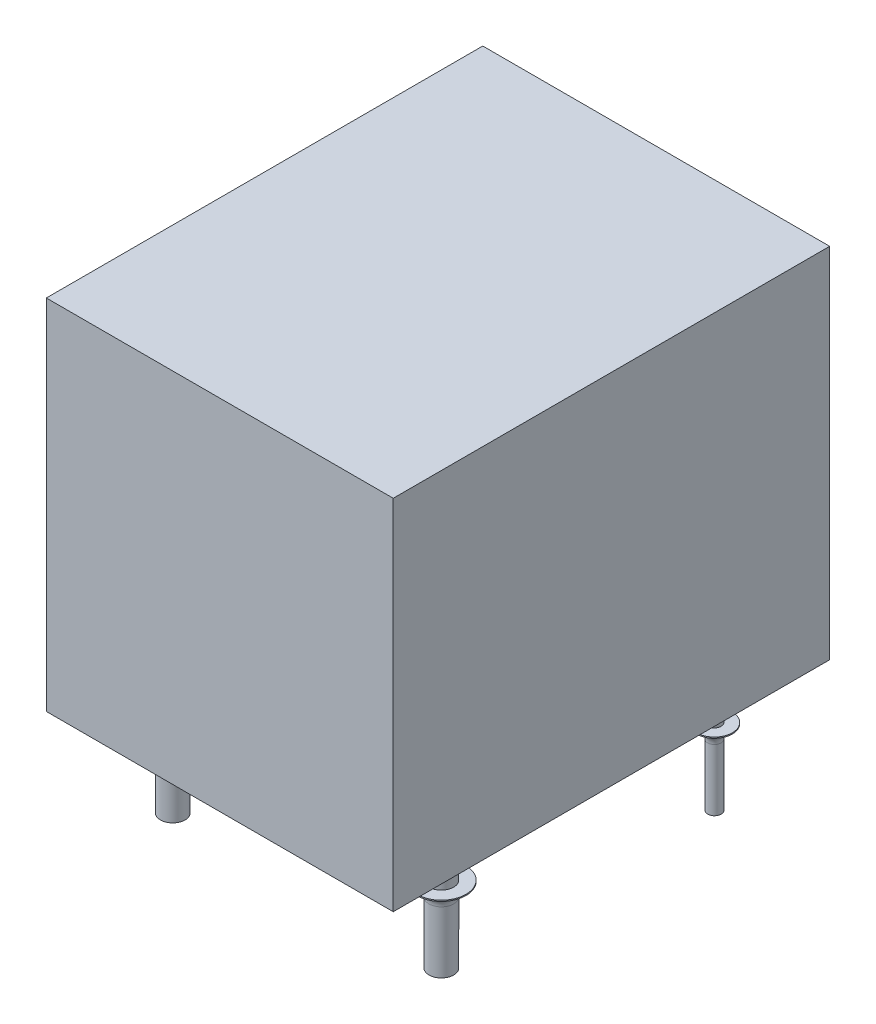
ISO-10303-21;
HEADER;
FILE_DESCRIPTION(('STEP AP214'),'2;1');
FILE_NAME('part.step','',(''),(''),'','','');
FILE_SCHEMA(('AUTOMOTIVE_DESIGN { 1 0 10303 214 1 1 1 1 }'));
ENDSEC;
DATA;
#1=APPLICATION_CONTEXT('core data for automotive mechanical design processes');
#2=APPLICATION_PROTOCOL_DEFINITION('international standard','automotive_design',2000,#1);
#3=PRODUCT_CONTEXT('',#1,'mechanical');
#4=PRODUCT('Part','Part','',(#3));
#5=PRODUCT_RELATED_PRODUCT_CATEGORY('part','',(#4));
#6=PRODUCT_DEFINITION_FORMATION('','',#4);
#7=PRODUCT_DEFINITION_CONTEXT('part definition',#1,'design');
#8=PRODUCT_DEFINITION('design','',#6,#7);
#9=PRODUCT_DEFINITION_SHAPE('','',#8);
#10=(LENGTH_UNIT() NAMED_UNIT(*) SI_UNIT(.MILLI.,.METRE.));
#11=(NAMED_UNIT(*) PLANE_ANGLE_UNIT() SI_UNIT($,.RADIAN.));
#12=(NAMED_UNIT(*) SI_UNIT($,.STERADIAN.) SOLID_ANGLE_UNIT());
#13=UNCERTAINTY_MEASURE_WITH_UNIT(LENGTH_MEASURE(1.E-05),#10,'distance_accuracy_value','');
#14=(GEOMETRIC_REPRESENTATION_CONTEXT(3) GLOBAL_UNCERTAINTY_ASSIGNED_CONTEXT((#13)) GLOBAL_UNIT_ASSIGNED_CONTEXT((#10,
#11,#12)) REPRESENTATION_CONTEXT('',''));
#15=CARTESIAN_POINT('',(0.,0.,0.));
#16=DIRECTION('',(0.,0.,1.));
#17=DIRECTION('',(1.,0.,0.));
#18=AXIS2_PLACEMENT_3D('',#15,#16,#17);
#19=CARTESIAN_POINT('',(13.75,-5.,-16.1));
#20=DIRECTION('',(0.,1.,0.));
#21=DIRECTION('',(0.,0.,1.));
#22=AXIS2_PLACEMENT_3D('',#19,#20,#21);
#23=CYLINDRICAL_SURFACE('',#22,0.300000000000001);
#24=CARTESIAN_POINT('',(13.75,0.,-16.1));
#25=DIRECTION('',(0.,-1.,0.));
#26=DIRECTION('',(0.,0.,-1.));
#27=AXIS2_PLACEMENT_3D('',#24,#25,#26);
#28=CIRCLE('',#27,0.300000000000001);
#29=CARTESIAN_POINT('',(13.75,0.,-16.4));
#30=VERTEX_POINT('',#29);
#31=EDGE_CURVE('E188',#30,#30,#28,.T.);
#32=ORIENTED_EDGE('',*,*,#31,.T.);
#33=EDGE_LOOP('',(#32));
#34=FACE_BOUND('',#33,.T.);
#35=CARTESIAN_POINT('',(13.75,-1.6,-16.1));
#36=DIRECTION('',(0.,-1.,0.));
#37=DIRECTION('',(0.,0.,-1.));
#38=AXIS2_PLACEMENT_3D('',#35,#36,#37);
#39=CIRCLE('',#38,0.300000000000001);
#40=CARTESIAN_POINT('',(13.75,-1.6,-16.4));
#41=VERTEX_POINT('',#40);
#42=EDGE_CURVE('E124',#41,#41,#39,.T.);
#43=ORIENTED_EDGE('',*,*,#42,.F.);
#44=EDGE_LOOP('',(#43));
#45=FACE_BOUND('',#44,.T.);
#46=ADVANCED_FACE('F34',(#34,#45),#23,.T.);
#47=CARTESIAN_POINT('',(1.75,-5.,-16.1));
#48=DIRECTION('',(0.,1.,0.));
#49=DIRECTION('',(0.,0.,1.));
#50=AXIS2_PLACEMENT_3D('',#47,#48,#49);
#51=CYLINDRICAL_SURFACE('',#50,0.300000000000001);
#52=CARTESIAN_POINT('',(1.75,0.,-16.1));
#53=DIRECTION('',(0.,-1.,0.));
#54=DIRECTION('',(0.,0.,-1.));
#55=AXIS2_PLACEMENT_3D('',#52,#53,#54);
#56=CIRCLE('',#55,0.300000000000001);
#57=CARTESIAN_POINT('',(1.75,0.,-16.4));
#58=VERTEX_POINT('',#57);
#59=EDGE_CURVE('E187',#58,#58,#56,.T.);
#60=ORIENTED_EDGE('',*,*,#59,.T.);
#61=EDGE_LOOP('',(#60));
#62=FACE_BOUND('',#61,.T.);
#63=CARTESIAN_POINT('',(1.75,-1.6,-16.1));
#64=DIRECTION('',(0.,-1.,0.));
#65=DIRECTION('',(0.,0.,-1.));
#66=AXIS2_PLACEMENT_3D('',#63,#64,#65);
#67=CIRCLE('',#66,0.300000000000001);
#68=CARTESIAN_POINT('',(1.75,-1.6,-16.4));
#69=VERTEX_POINT('',#68);
#70=EDGE_CURVE('E121',#69,#69,#67,.T.);
#71=ORIENTED_EDGE('',*,*,#70,.F.);
#72=EDGE_LOOP('',(#71));
#73=FACE_BOUND('',#72,.T.);
#74=ADVANCED_FACE('F155',(#62,#73),#51,.T.);
#75=CARTESIAN_POINT('',(7.75,-5.,-18.1));
#76=DIRECTION('',(0.,1.,0.));
#77=DIRECTION('',(0.,0.,1.));
#78=AXIS2_PLACEMENT_3D('',#75,#76,#77);
#79=CYLINDRICAL_SURFACE('',#78,0.549999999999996);
#80=CARTESIAN_POINT('',(7.75,0.,-18.1));
#81=DIRECTION('',(0.,-1.,0.));
#82=DIRECTION('',(0.,0.,-1.));
#83=AXIS2_PLACEMENT_3D('',#80,#81,#82);
#84=CIRCLE('',#83,0.549999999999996);
#85=CARTESIAN_POINT('',(7.75,0.,-18.65));
#86=VERTEX_POINT('',#85);
#87=EDGE_CURVE('E200',#86,#86,#84,.T.);
#88=ORIENTED_EDGE('',*,*,#87,.T.);
#89=EDGE_LOOP('',(#88));
#90=FACE_BOUND('',#89,.T.);
#91=CARTESIAN_POINT('',(7.75,-1.6,-18.1));
#92=DIRECTION('',(0.,-1.,0.));
#93=DIRECTION('',(0.,0.,-1.));
#94=AXIS2_PLACEMENT_3D('',#91,#92,#93);
#95=CIRCLE('',#94,0.549999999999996);
#96=CARTESIAN_POINT('',(7.75,-1.6,-18.65));
#97=VERTEX_POINT('',#96);
#98=EDGE_CURVE('E118',#97,#97,#95,.T.);
#99=ORIENTED_EDGE('',*,*,#98,.F.);
#100=EDGE_LOOP('',(#99));
#101=FACE_BOUND('',#100,.T.);
#102=ADVANCED_FACE('F162',(#90,#101),#79,.T.);
#103=CARTESIAN_POINT('',(13.75,-5.,-3.9));
#104=DIRECTION('',(0.,1.,0.));
#105=DIRECTION('',(0.,0.,1.));
#106=AXIS2_PLACEMENT_3D('',#103,#104,#105);
#107=CYLINDRICAL_SURFACE('',#106,0.55);
#108=CARTESIAN_POINT('',(13.75,0.,-3.9));
#109=DIRECTION('',(0.,-1.,0.));
#110=DIRECTION('',(0.,0.,-1.));
#111=AXIS2_PLACEMENT_3D('',#108,#109,#110);
#112=CIRCLE('',#111,0.55);
#113=CARTESIAN_POINT('',(13.75,0.,-4.45));
#114=VERTEX_POINT('',#113);
#115=EDGE_CURVE('E205',#114,#114,#112,.T.);
#116=ORIENTED_EDGE('',*,*,#115,.T.);
#117=EDGE_LOOP('',(#116));
#118=FACE_BOUND('',#117,.T.);
#119=CARTESIAN_POINT('',(13.75,-1.6,-3.9));
#120=DIRECTION('',(0.,-1.,0.));
#121=DIRECTION('',(0.,0.,-1.));
#122=AXIS2_PLACEMENT_3D('',#119,#120,#121);
#123=CIRCLE('',#122,0.55);
#124=CARTESIAN_POINT('',(13.75,-1.6,-4.45));
#125=VERTEX_POINT('',#124);
#126=EDGE_CURVE('E115',#125,#125,#123,.T.);
#127=ORIENTED_EDGE('',*,*,#126,.F.);
#128=EDGE_LOOP('',(#127));
#129=FACE_BOUND('',#128,.T.);
#130=ADVANCED_FACE('F234',(#118,#129),#107,.T.);
#131=CARTESIAN_POINT('',(1.75,-5.,-3.9));
#132=DIRECTION('',(0.,1.,0.));
#133=DIRECTION('',(0.,0.,1.));
#134=AXIS2_PLACEMENT_3D('',#131,#132,#133);
#135=CYLINDRICAL_SURFACE('',#134,0.55);
#136=CARTESIAN_POINT('',(1.75,0.,-3.9));
#137=DIRECTION('',(0.,-1.,0.));
#138=DIRECTION('',(0.,0.,-1.));
#139=AXIS2_PLACEMENT_3D('',#136,#137,#138);
#140=CIRCLE('',#139,0.55);
#141=CARTESIAN_POINT('',(1.75,0.,-4.45));
#142=VERTEX_POINT('',#141);
#143=EDGE_CURVE('E211',#142,#142,#140,.T.);
#144=ORIENTED_EDGE('',*,*,#143,.T.);
#145=EDGE_LOOP('',(#144));
#146=FACE_BOUND('',#145,.T.);
#147=CARTESIAN_POINT('',(1.75,-1.6,-3.9));
#148=DIRECTION('',(0.,-1.,0.));
#149=DIRECTION('',(0.,0.,-1.));
#150=AXIS2_PLACEMENT_3D('',#147,#148,#149);
#151=CIRCLE('',#150,0.55);
#152=CARTESIAN_POINT('',(1.75,-1.6,-4.45));
#153=VERTEX_POINT('',#152);
#154=EDGE_CURVE('E112',#153,#153,#151,.T.);
#155=ORIENTED_EDGE('',*,*,#154,.F.);
#156=EDGE_LOOP('',(#155));
#157=FACE_BOUND('',#156,.T.);
#158=ADVANCED_FACE('F219',(#146,#157),#135,.T.);
#159=CARTESIAN_POINT('',(0.,0.,0.));
#160=DIRECTION('',(0.,-1.,0.));
#161=DIRECTION('',(0.,0.,-1.));
#162=AXIS2_PLACEMENT_3D('',#159,#160,#161);
#163=PLANE('',#162);
#164=ORIENTED_EDGE('',*,*,#59,.F.);
#165=EDGE_LOOP('',(#164));
#166=FACE_BOUND('',#165,.T.);
#167=ORIENTED_EDGE('',*,*,#115,.F.);
#168=EDGE_LOOP('',(#167));
#169=FACE_BOUND('',#168,.T.);
#170=DIRECTION('',(0.,0.,1.));
#171=VECTOR('',#170,1.);
#172=CARTESIAN_POINT('',(0.,0.,0.));
#173=LINE('',#172,#171);
#174=CARTESIAN_POINT('',(0.,0.,-19.5));
#175=VERTEX_POINT('',#174);
#176=CARTESIAN_POINT('',(0.,0.,0.));
#177=VERTEX_POINT('',#176);
#178=EDGE_CURVE('E102',#175,#177,#173,.T.);
#179=ORIENTED_EDGE('',*,*,#178,.F.);
#180=DIRECTION('',(-1.,0.,0.));
#181=VECTOR('',#180,1.);
#182=CARTESIAN_POINT('',(0.,0.,-19.5));
#183=LINE('',#182,#181);
#184=CARTESIAN_POINT('',(15.5,0.,-19.5));
#185=VERTEX_POINT('',#184);
#186=EDGE_CURVE('E74',#185,#175,#183,.T.);
#187=ORIENTED_EDGE('',*,*,#186,.F.);
#188=DIRECTION('',(0.,0.,-1.));
#189=VECTOR('',#188,1.);
#190=CARTESIAN_POINT('',(15.5,0.,0.));
#191=LINE('',#190,#189);
#192=CARTESIAN_POINT('',(15.5,0.,0.));
#193=VERTEX_POINT('',#192);
#194=EDGE_CURVE('E68',#193,#185,#191,.T.);
#195=ORIENTED_EDGE('',*,*,#194,.F.);
#196=DIRECTION('',(1.,0.,0.));
#197=VECTOR('',#196,1.);
#198=CARTESIAN_POINT('',(0.,0.,0.));
#199=LINE('',#198,#197);
#200=EDGE_CURVE('E92',#177,#193,#199,.T.);
#201=ORIENTED_EDGE('',*,*,#200,.F.);
#202=EDGE_LOOP('',(#179,#187,#195,#201));
#203=FACE_BOUND('',#202,.T.);
#204=ORIENTED_EDGE('',*,*,#143,.F.);
#205=EDGE_LOOP('',(#204));
#206=FACE_BOUND('',#205,.T.);
#207=ORIENTED_EDGE('',*,*,#87,.F.);
#208=EDGE_LOOP('',(#207));
#209=FACE_BOUND('',#208,.T.);
#210=ORIENTED_EDGE('',*,*,#31,.F.);
#211=EDGE_LOOP('',(#210));
#212=FACE_BOUND('',#211,.T.);
#213=ADVANCED_FACE('F222',(#166,#169,#203,#206,#209,#212),#163,.T.);
#214=CARTESIAN_POINT('',(0.,16.,0.));
#215=DIRECTION('',(1.,0.,0.));
#216=DIRECTION('',(0.,0.,-1.));
#217=AXIS2_PLACEMENT_3D('',#214,#215,#216);
#218=PLANE('',#217);
#219=ORIENTED_EDGE('',*,*,#178,.T.);
#220=DIRECTION('',(0.,-1.,0.));
#221=VECTOR('',#220,1.);
#222=CARTESIAN_POINT('',(0.,16.,0.));
#223=LINE('',#222,#221);
#224=CARTESIAN_POINT('',(0.,16.,0.));
#225=VERTEX_POINT('',#224);
#226=EDGE_CURVE('E93',#225,#177,#223,.T.);
#227=ORIENTED_EDGE('',*,*,#226,.F.);
#228=DIRECTION('',(0.,0.,1.));
#229=VECTOR('',#228,1.);
#230=CARTESIAN_POINT('',(0.,16.,0.));
#231=LINE('',#230,#229);
#232=CARTESIAN_POINT('',(0.,16.,-19.5));
#233=VERTEX_POINT('',#232);
#234=EDGE_CURVE('E87',#233,#225,#231,.T.);
#235=ORIENTED_EDGE('',*,*,#234,.F.);
#236=DIRECTION('',(0.,-1.,0.));
#237=VECTOR('',#236,1.);
#238=CARTESIAN_POINT('',(0.,16.,-19.5));
#239=LINE('',#238,#237);
#240=EDGE_CURVE('E98',#233,#175,#239,.T.);
#241=ORIENTED_EDGE('',*,*,#240,.T.);
#242=EDGE_LOOP('',(#219,#227,#235,#241));
#243=FACE_BOUND('',#242,.T.);
#244=ADVANCED_FACE('F225',(#243),#218,.F.);
#245=CARTESIAN_POINT('',(0.,16.,0.));
#246=DIRECTION('',(0.,0.,-1.));
#247=DIRECTION('',(-1.,0.,0.));
#248=AXIS2_PLACEMENT_3D('',#245,#246,#247);
#249=PLANE('',#248);
#250=ORIENTED_EDGE('',*,*,#200,.T.);
#251=DIRECTION('',(0.,-1.,0.));
#252=VECTOR('',#251,1.);
#253=CARTESIAN_POINT('',(15.5,16.,0.));
#254=LINE('',#253,#252);
#255=CARTESIAN_POINT('',(15.5,16.,0.));
#256=VERTEX_POINT('',#255);
#257=EDGE_CURVE('E90',#256,#193,#254,.T.);
#258=ORIENTED_EDGE('',*,*,#257,.F.);
#259=DIRECTION('',(1.,0.,0.));
#260=VECTOR('',#259,1.);
#261=CARTESIAN_POINT('',(0.,16.,0.));
#262=LINE('',#261,#260);
#263=EDGE_CURVE('E82',#225,#256,#262,.T.);
#264=ORIENTED_EDGE('',*,*,#263,.F.);
#265=ORIENTED_EDGE('',*,*,#226,.T.);
#266=EDGE_LOOP('',(#250,#258,#264,#265));
#267=FACE_BOUND('',#266,.T.);
#268=ADVANCED_FACE('F91',(#267),#249,.F.);
#269=CARTESIAN_POINT('',(15.5,16.,0.));
#270=DIRECTION('',(-1.,0.,0.));
#271=DIRECTION('',(0.,0.,1.));
#272=AXIS2_PLACEMENT_3D('',#269,#270,#271);
#273=PLANE('',#272);
#274=ORIENTED_EDGE('',*,*,#194,.T.);
#275=DIRECTION('',(0.,-1.,0.));
#276=VECTOR('',#275,1.);
#277=CARTESIAN_POINT('',(15.5,16.,-19.5));
#278=LINE('',#277,#276);
#279=CARTESIAN_POINT('',(15.5,16.,-19.5));
#280=VERTEX_POINT('',#279);
#281=EDGE_CURVE('E94',#280,#185,#278,.T.);
#282=ORIENTED_EDGE('',*,*,#281,.F.);
#283=DIRECTION('',(0.,0.,-1.));
#284=VECTOR('',#283,1.);
#285=CARTESIAN_POINT('',(15.5,16.,0.));
#286=LINE('',#285,#284);
#287=EDGE_CURVE('E85',#256,#280,#286,.T.);
#288=ORIENTED_EDGE('',*,*,#287,.F.);
#289=ORIENTED_EDGE('',*,*,#257,.T.);
#290=EDGE_LOOP('',(#274,#282,#288,#289));
#291=FACE_BOUND('',#290,.T.);
#292=ADVANCED_FACE('F96',(#291),#273,.F.);
#293=CARTESIAN_POINT('',(0.,16.,-19.5));
#294=DIRECTION('',(0.,0.,1.));
#295=DIRECTION('',(1.,0.,0.));
#296=AXIS2_PLACEMENT_3D('',#293,#294,#295);
#297=PLANE('',#296);
#298=ORIENTED_EDGE('',*,*,#186,.T.);
#299=ORIENTED_EDGE('',*,*,#240,.F.);
#300=DIRECTION('',(-1.,0.,0.));
#301=VECTOR('',#300,1.);
#302=CARTESIAN_POINT('',(0.,16.,-19.5));
#303=LINE('',#302,#301);
#304=EDGE_CURVE('E51',#280,#233,#303,.T.);
#305=ORIENTED_EDGE('',*,*,#304,.F.);
#306=ORIENTED_EDGE('',*,*,#281,.T.);
#307=EDGE_LOOP('',(#298,#299,#305,#306));
#308=FACE_BOUND('',#307,.T.);
#309=ADVANCED_FACE('F356',(#308),#297,.F.);
#310=CARTESIAN_POINT('',(0.,16.,0.));
#311=DIRECTION('',(0.,-1.,0.));
#312=DIRECTION('',(0.,0.,-1.));
#313=AXIS2_PLACEMENT_3D('',#310,#311,#312);
#314=PLANE('',#313);
#315=ORIENTED_EDGE('',*,*,#234,.T.);
#316=ORIENTED_EDGE('',*,*,#263,.T.);
#317=ORIENTED_EDGE('',*,*,#287,.T.);
#318=ORIENTED_EDGE('',*,*,#304,.T.);
#319=EDGE_LOOP('',(#315,#316,#317,#318));
#320=FACE_BOUND('',#319,.T.);
#321=ADVANCED_FACE('F83',(#320),#314,.F.);
#322=CARTESIAN_POINT('',(1.75,-1.6,-3.9));
#323=DIRECTION('',(0.,-1.,0.));
#324=DIRECTION('',(0.,0.,-1.));
#325=AXIS2_PLACEMENT_3D('',#322,#323,#324);
#326=PLANE('',#325);
#327=CARTESIAN_POINT('',(1.75,-1.6,-3.9));
#328=DIRECTION('',(0.,-1.,0.));
#329=DIRECTION('',(0.,0.,-1.));
#330=AXIS2_PLACEMENT_3D('',#327,#328,#329);
#331=CIRCLE('',#330,1.1);
#332=CARTESIAN_POINT('',(1.75,-1.6,-5.));
#333=VERTEX_POINT('',#332);
#334=EDGE_CURVE('E196',#333,#333,#331,.T.);
#335=ORIENTED_EDGE('',*,*,#334,.F.);
#336=EDGE_LOOP('',(#335));
#337=FACE_BOUND('',#336,.T.);
#338=ORIENTED_EDGE('',*,*,#154,.T.);
#339=EDGE_LOOP('',(#338));
#340=FACE_BOUND('',#339,.T.);
#341=ADVANCED_FACE('F267',(#337,#340),#326,.F.);
#342=CARTESIAN_POINT('',(1.75,-1.65,-3.9));
#343=DIRECTION('',(0.,1.,0.));
#344=DIRECTION('',(0.,0.,1.));
#345=AXIS2_PLACEMENT_3D('',#342,#343,#344);
#346=CYLINDRICAL_SURFACE('',#345,1.1);
#347=CARTESIAN_POINT('',(1.75,-1.65,-3.9));
#348=DIRECTION('',(0.,-1.,0.));
#349=DIRECTION('',(0.,0.,-1.));
#350=AXIS2_PLACEMENT_3D('',#347,#348,#349);
#351=CIRCLE('',#350,1.1);
#352=CARTESIAN_POINT('',(1.75,-1.65,-5.));
#353=VERTEX_POINT('',#352);
#354=EDGE_CURVE('E193',#353,#353,#351,.T.);
#355=ORIENTED_EDGE('',*,*,#354,.F.);
#356=EDGE_LOOP('',(#355));
#357=FACE_BOUND('',#356,.T.);
#358=ORIENTED_EDGE('',*,*,#334,.T.);
#359=EDGE_LOOP('',(#358));
#360=FACE_BOUND('',#359,.T.);
#361=ADVANCED_FACE('F270',(#357,#360),#346,.T.);
#362=CARTESIAN_POINT('',(1.75,-5.,-3.9));
#363=DIRECTION('',(0.,-1.,0.));
#364=DIRECTION('',(0.,0.,-1.));
#365=AXIS2_PLACEMENT_3D('',#362,#363,#364);
#366=PLANE('',#365);
#367=CARTESIAN_POINT('',(1.75,-5.,-3.9));
#368=DIRECTION('',(0.,-1.,0.));
#369=DIRECTION('',(0.,0.,-1.));
#370=AXIS2_PLACEMENT_3D('',#367,#368,#369);
#371=CIRCLE('',#370,0.55);
#372=CARTESIAN_POINT('',(1.75,-5.,-4.45));
#373=VERTEX_POINT('',#372);
#374=EDGE_CURVE('E105',#373,#373,#371,.T.);
#375=ORIENTED_EDGE('',*,*,#374,.T.);
#376=EDGE_LOOP('',(#375));
#377=FACE_BOUND('',#376,.T.);
#378=ADVANCED_FACE('F273',(#377),#366,.T.);
#379=CARTESIAN_POINT('',(1.75,-2.24791303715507,-3.9));
#380=DIRECTION('',(0.,1.,0.));
#381=DIRECTION('',(0.,0.,1.));
#382=AXIS2_PLACEMENT_3D('',#379,#380,#381);
#383=CIRCLE('',#382,0.55);
#384=CARTESIAN_POINT('',(1.75,-2.24791303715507,-3.35));
#385=VERTEX_POINT('',#384);
#386=EDGE_CURVE('E11',#385,#385,#383,.F.);
#387=ORIENTED_EDGE('',*,*,#386,.T.);
#388=EDGE_LOOP('',(#387));
#389=FACE_BOUND('',#388,.T.);
#390=ORIENTED_EDGE('',*,*,#374,.F.);
#391=EDGE_LOOP('',(#390));
#392=FACE_BOUND('',#391,.T.);
#393=ADVANCED_FACE('F262',(#389,#392),#135,.T.);
#394=CARTESIAN_POINT('',(13.75,-1.6,-3.9));
#395=DIRECTION('',(0.,-1.,0.));
#396=DIRECTION('',(0.,0.,-1.));
#397=AXIS2_PLACEMENT_3D('',#394,#395,#396);
#398=PLANE('',#397);
#399=CARTESIAN_POINT('',(13.75,-1.6,-3.9));
#400=DIRECTION('',(0.,-1.,0.));
#401=DIRECTION('',(0.,0.,-1.));
#402=AXIS2_PLACEMENT_3D('',#399,#400,#401);
#403=CIRCLE('',#402,1.1);
#404=CARTESIAN_POINT('',(13.75,-1.6,-5.));
#405=VERTEX_POINT('',#404);
#406=EDGE_CURVE('E286',#405,#405,#403,.T.);
#407=ORIENTED_EDGE('',*,*,#406,.F.);
#408=EDGE_LOOP('',(#407));
#409=FACE_BOUND('',#408,.T.);
#410=ORIENTED_EDGE('',*,*,#126,.T.);
#411=EDGE_LOOP('',(#410));
#412=FACE_BOUND('',#411,.T.);
#413=ADVANCED_FACE('F258',(#409,#412),#398,.F.);
#414=CARTESIAN_POINT('',(13.75,-1.65,-3.9));
#415=DIRECTION('',(0.,1.,0.));
#416=DIRECTION('',(0.,0.,1.));
#417=AXIS2_PLACEMENT_3D('',#414,#415,#416);
#418=CYLINDRICAL_SURFACE('',#417,1.1);
#419=CARTESIAN_POINT('',(13.75,-1.65,-3.9));
#420=DIRECTION('',(0.,-1.,0.));
#421=DIRECTION('',(0.,0.,-1.));
#422=AXIS2_PLACEMENT_3D('',#419,#420,#421);
#423=CIRCLE('',#422,1.1);
#424=CARTESIAN_POINT('',(13.75,-1.65,-5.));
#425=VERTEX_POINT('',#424);
#426=EDGE_CURVE('E285',#425,#425,#423,.T.);
#427=ORIENTED_EDGE('',*,*,#426,.F.);
#428=EDGE_LOOP('',(#427));
#429=FACE_BOUND('',#428,.T.);
#430=ORIENTED_EDGE('',*,*,#406,.T.);
#431=EDGE_LOOP('',(#430));
#432=FACE_BOUND('',#431,.T.);
#433=ADVANCED_FACE('F261',(#429,#432),#418,.T.);
#434=CARTESIAN_POINT('',(13.75,-5.,-3.9));
#435=DIRECTION('',(0.,-1.,0.));
#436=DIRECTION('',(0.,0.,-1.));
#437=AXIS2_PLACEMENT_3D('',#434,#435,#436);
#438=PLANE('',#437);
#439=CARTESIAN_POINT('',(13.75,-5.,-3.9));
#440=DIRECTION('',(0.,-1.,0.));
#441=DIRECTION('',(0.,0.,-1.));
#442=AXIS2_PLACEMENT_3D('',#439,#440,#441);
#443=CIRCLE('',#442,0.55);
#444=CARTESIAN_POINT('',(13.75,-5.,-4.45));
#445=VERTEX_POINT('',#444);
#446=EDGE_CURVE('E208',#445,#445,#443,.T.);
#447=ORIENTED_EDGE('',*,*,#446,.T.);
#448=EDGE_LOOP('',(#447));
#449=FACE_BOUND('',#448,.T.);
#450=ADVANCED_FACE('F251',(#449),#438,.T.);
#451=CARTESIAN_POINT('',(13.75,-2.24791303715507,-3.9));
#452=DIRECTION('',(0.,1.,0.));
#453=DIRECTION('',(0.,0.,1.));
#454=AXIS2_PLACEMENT_3D('',#451,#452,#453);
#455=CIRCLE('',#454,0.55);
#456=CARTESIAN_POINT('',(13.75,-2.24791303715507,-3.35));
#457=VERTEX_POINT('',#456);
#458=EDGE_CURVE('E43',#457,#457,#455,.F.);
#459=ORIENTED_EDGE('',*,*,#458,.T.);
#460=EDGE_LOOP('',(#459));
#461=FACE_BOUND('',#460,.T.);
#462=ORIENTED_EDGE('',*,*,#446,.F.);
#463=EDGE_LOOP('',(#462));
#464=FACE_BOUND('',#463,.T.);
#465=ADVANCED_FACE('F138',(#461,#464),#107,.T.);
#466=CARTESIAN_POINT('',(7.75,-1.6,-18.1));
#467=DIRECTION('',(0.,-1.,0.));
#468=DIRECTION('',(0.,0.,-1.));
#469=AXIS2_PLACEMENT_3D('',#466,#467,#468);
#470=PLANE('',#469);
#471=CARTESIAN_POINT('',(7.75,-1.6,-18.1));
#472=DIRECTION('',(0.,-1.,0.));
#473=DIRECTION('',(0.,0.,-1.));
#474=AXIS2_PLACEMENT_3D('',#471,#472,#473);
#475=CIRCLE('',#474,1.1);
#476=CARTESIAN_POINT('',(7.75,-1.6,-19.2));
#477=VERTEX_POINT('',#476);
#478=EDGE_CURVE('E293',#477,#477,#475,.T.);
#479=ORIENTED_EDGE('',*,*,#478,.F.);
#480=EDGE_LOOP('',(#479));
#481=FACE_BOUND('',#480,.T.);
#482=ORIENTED_EDGE('',*,*,#98,.T.);
#483=EDGE_LOOP('',(#482));
#484=FACE_BOUND('',#483,.T.);
#485=ADVANCED_FACE('F239',(#481,#484),#470,.F.);
#486=CARTESIAN_POINT('',(7.75,-1.65,-18.1));
#487=DIRECTION('',(0.,1.,0.));
#488=DIRECTION('',(0.,0.,1.));
#489=AXIS2_PLACEMENT_3D('',#486,#487,#488);
#490=CYLINDRICAL_SURFACE('',#489,1.1);
#491=CARTESIAN_POINT('',(7.75,-1.65,-18.1));
#492=DIRECTION('',(0.,-1.,0.));
#493=DIRECTION('',(0.,0.,-1.));
#494=AXIS2_PLACEMENT_3D('',#491,#492,#493);
#495=CIRCLE('',#494,1.1);
#496=CARTESIAN_POINT('',(7.75,-1.65,-19.2));
#497=VERTEX_POINT('',#496);
#498=EDGE_CURVE('E290',#497,#497,#495,.T.);
#499=ORIENTED_EDGE('',*,*,#498,.F.);
#500=EDGE_LOOP('',(#499));
#501=FACE_BOUND('',#500,.T.);
#502=ORIENTED_EDGE('',*,*,#478,.T.);
#503=EDGE_LOOP('',(#502));
#504=FACE_BOUND('',#503,.T.);
#505=ADVANCED_FACE('F241',(#501,#504),#490,.T.);
#506=CARTESIAN_POINT('',(7.75,-5.,-18.1));
#507=DIRECTION('',(0.,-1.,0.));
#508=DIRECTION('',(0.,0.,-1.));
#509=AXIS2_PLACEMENT_3D('',#506,#507,#508);
#510=PLANE('',#509);
#511=CARTESIAN_POINT('',(7.75,-5.,-18.1));
#512=DIRECTION('',(0.,-1.,0.));
#513=DIRECTION('',(0.,0.,-1.));
#514=AXIS2_PLACEMENT_3D('',#511,#512,#513);
#515=CIRCLE('',#514,0.549999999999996);
#516=CARTESIAN_POINT('',(7.75,-5.,-18.65));
#517=VERTEX_POINT('',#516);
#518=EDGE_CURVE('E202',#517,#517,#515,.T.);
#519=ORIENTED_EDGE('',*,*,#518,.T.);
#520=EDGE_LOOP('',(#519));
#521=FACE_BOUND('',#520,.T.);
#522=ADVANCED_FACE('F248',(#521),#510,.T.);
#523=CARTESIAN_POINT('',(7.75,-2.24791303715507,-18.1));
#524=DIRECTION('',(0.,1.,0.));
#525=DIRECTION('',(0.,0.,1.));
#526=AXIS2_PLACEMENT_3D('',#523,#524,#525);
#527=CIRCLE('',#526,0.549999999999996);
#528=CARTESIAN_POINT('',(7.75,-2.24791303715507,-17.55));
#529=VERTEX_POINT('',#528);
#530=EDGE_CURVE('E133',#529,#529,#527,.F.);
#531=ORIENTED_EDGE('',*,*,#530,.T.);
#532=EDGE_LOOP('',(#531));
#533=FACE_BOUND('',#532,.T.);
#534=ORIENTED_EDGE('',*,*,#518,.F.);
#535=EDGE_LOOP('',(#534));
#536=FACE_BOUND('',#535,.T.);
#537=ADVANCED_FACE('F236',(#533,#536),#79,.T.);
#538=CARTESIAN_POINT('',(1.75,-1.6,-16.1));
#539=DIRECTION('',(0.,-1.,0.));
#540=DIRECTION('',(0.,0.,-1.));
#541=AXIS2_PLACEMENT_3D('',#538,#539,#540);
#542=PLANE('',#541);
#543=CARTESIAN_POINT('',(1.75,-1.6,-16.1));
#544=DIRECTION('',(0.,-1.,0.));
#545=DIRECTION('',(0.,0.,-1.));
#546=AXIS2_PLACEMENT_3D('',#543,#544,#545);
#547=CIRCLE('',#546,0.799999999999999);
#548=CARTESIAN_POINT('',(1.75,-1.6,-16.9));
#549=VERTEX_POINT('',#548);
#550=EDGE_CURVE('E299',#549,#549,#547,.T.);
#551=ORIENTED_EDGE('',*,*,#550,.F.);
#552=EDGE_LOOP('',(#551));
#553=FACE_BOUND('',#552,.T.);
#554=ORIENTED_EDGE('',*,*,#70,.T.);
#555=EDGE_LOOP('',(#554));
#556=FACE_BOUND('',#555,.T.);
#557=ADVANCED_FACE('F328',(#553,#556),#542,.F.);
#558=CARTESIAN_POINT('',(1.75,-1.65,-16.1));
#559=DIRECTION('',(0.,1.,0.));
#560=DIRECTION('',(0.,0.,1.));
#561=AXIS2_PLACEMENT_3D('',#558,#559,#560);
#562=CYLINDRICAL_SURFACE('',#561,0.799999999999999);
#563=CARTESIAN_POINT('',(1.75,-1.65,-16.1));
#564=DIRECTION('',(0.,-1.,0.));
#565=DIRECTION('',(0.,0.,-1.));
#566=AXIS2_PLACEMENT_3D('',#563,#564,#565);
#567=CIRCLE('',#566,0.799999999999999);
#568=CARTESIAN_POINT('',(1.75,-1.65,-16.9));
#569=VERTEX_POINT('',#568);
#570=EDGE_CURVE('E296',#569,#569,#567,.T.);
#571=ORIENTED_EDGE('',*,*,#570,.F.);
#572=EDGE_LOOP('',(#571));
#573=FACE_BOUND('',#572,.T.);
#574=ORIENTED_EDGE('',*,*,#550,.T.);
#575=EDGE_LOOP('',(#574));
#576=FACE_BOUND('',#575,.T.);
#577=ADVANCED_FACE('F255',(#573,#576),#562,.T.);
#578=CARTESIAN_POINT('',(1.75,-5.,-16.1));
#579=DIRECTION('',(0.,-1.,0.));
#580=DIRECTION('',(0.,0.,-1.));
#581=AXIS2_PLACEMENT_3D('',#578,#579,#580);
#582=PLANE('',#581);
#583=CARTESIAN_POINT('',(1.75,-5.,-16.1));
#584=DIRECTION('',(0.,-1.,0.));
#585=DIRECTION('',(0.,0.,-1.));
#586=AXIS2_PLACEMENT_3D('',#583,#584,#585);
#587=CIRCLE('',#586,0.300000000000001);
#588=CARTESIAN_POINT('',(1.75,-5.,-16.4));
#589=VERTEX_POINT('',#588);
#590=EDGE_CURVE('E191',#589,#589,#587,.T.);
#591=ORIENTED_EDGE('',*,*,#590,.T.);
#592=EDGE_LOOP('',(#591));
#593=FACE_BOUND('',#592,.T.);
#594=ADVANCED_FACE('F326',(#593),#582,.T.);
#595=CARTESIAN_POINT('',(1.75,-2.24160797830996,-16.1));
#596=DIRECTION('',(0.,1.,0.));
#597=DIRECTION('',(0.,0.,1.));
#598=AXIS2_PLACEMENT_3D('',#595,#596,#597);
#599=CIRCLE('',#598,0.300000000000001);
#600=CARTESIAN_POINT('',(1.75,-2.24160797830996,-15.8));
#601=VERTEX_POINT('',#600);
#602=EDGE_CURVE('E127',#601,#601,#599,.F.);
#603=ORIENTED_EDGE('',*,*,#602,.T.);
#604=EDGE_LOOP('',(#603));
#605=FACE_BOUND('',#604,.T.);
#606=ORIENTED_EDGE('',*,*,#590,.F.);
#607=EDGE_LOOP('',(#606));
#608=FACE_BOUND('',#607,.T.);
#609=ADVANCED_FACE('F165',(#605,#608),#51,.T.);
#610=CARTESIAN_POINT('',(13.75,-1.6,-16.1));
#611=DIRECTION('',(0.,-1.,0.));
#612=DIRECTION('',(0.,0.,-1.));
#613=AXIS2_PLACEMENT_3D('',#610,#611,#612);
#614=PLANE('',#613);
#615=CARTESIAN_POINT('',(13.75,-1.6,-16.1));
#616=DIRECTION('',(0.,-1.,0.));
#617=DIRECTION('',(0.,0.,-1.));
#618=AXIS2_PLACEMENT_3D('',#615,#616,#617);
#619=CIRCLE('',#618,0.8);
#620=CARTESIAN_POINT('',(13.75,-1.6,-16.9));
#621=VERTEX_POINT('',#620);
#622=EDGE_CURVE('E305',#621,#621,#619,.T.);
#623=ORIENTED_EDGE('',*,*,#622,.F.);
#624=EDGE_LOOP('',(#623));
#625=FACE_BOUND('',#624,.T.);
#626=ORIENTED_EDGE('',*,*,#42,.T.);
#627=EDGE_LOOP('',(#626));
#628=FACE_BOUND('',#627,.T.);
#629=ADVANCED_FACE('F315',(#625,#628),#614,.F.);
#630=CARTESIAN_POINT('',(13.75,-1.65,-16.1));
#631=DIRECTION('',(0.,1.,0.));
#632=DIRECTION('',(0.,0.,1.));
#633=AXIS2_PLACEMENT_3D('',#630,#631,#632);
#634=CYLINDRICAL_SURFACE('',#633,0.8);
#635=CARTESIAN_POINT('',(13.75,-1.65,-16.1));
#636=DIRECTION('',(0.,-1.,0.));
#637=DIRECTION('',(0.,0.,-1.));
#638=AXIS2_PLACEMENT_3D('',#635,#636,#637);
#639=CIRCLE('',#638,0.8);
#640=CARTESIAN_POINT('',(13.75,-1.65,-16.9));
#641=VERTEX_POINT('',#640);
#642=EDGE_CURVE('E302',#641,#641,#639,.T.);
#643=ORIENTED_EDGE('',*,*,#642,.F.);
#644=EDGE_LOOP('',(#643));
#645=FACE_BOUND('',#644,.T.);
#646=ORIENTED_EDGE('',*,*,#622,.T.);
#647=EDGE_LOOP('',(#646));
#648=FACE_BOUND('',#647,.T.);
#649=ADVANCED_FACE('F180',(#645,#648),#634,.T.);
#650=CARTESIAN_POINT('',(13.75,-5.,-16.1));
#651=DIRECTION('',(0.,-1.,0.));
#652=DIRECTION('',(0.,0.,-1.));
#653=AXIS2_PLACEMENT_3D('',#650,#651,#652);
#654=PLANE('',#653);
#655=CARTESIAN_POINT('',(13.75,-5.,-16.1));
#656=DIRECTION('',(0.,-1.,0.));
#657=DIRECTION('',(0.,0.,-1.));
#658=AXIS2_PLACEMENT_3D('',#655,#656,#657);
#659=CIRCLE('',#658,0.300000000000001);
#660=CARTESIAN_POINT('',(13.75,-5.,-16.4));
#661=VERTEX_POINT('',#660);
#662=EDGE_CURVE('E186',#661,#661,#659,.T.);
#663=ORIENTED_EDGE('',*,*,#662,.T.);
#664=EDGE_LOOP('',(#663));
#665=FACE_BOUND('',#664,.T.);
#666=ADVANCED_FACE('F172',(#665),#654,.T.);
#667=CARTESIAN_POINT('',(13.75,-2.24160797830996,-16.1));
#668=DIRECTION('',(0.,1.,0.));
#669=DIRECTION('',(0.,0.,1.));
#670=AXIS2_PLACEMENT_3D('',#667,#668,#669);
#671=CIRCLE('',#670,0.300000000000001);
#672=CARTESIAN_POINT('',(13.75,-2.24160797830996,-15.8));
#673=VERTEX_POINT('',#672);
#674=EDGE_CURVE('E130',#673,#673,#671,.F.);
#675=ORIENTED_EDGE('',*,*,#674,.T.);
#676=EDGE_LOOP('',(#675));
#677=FACE_BOUND('',#676,.T.);
#678=ORIENTED_EDGE('',*,*,#662,.F.);
#679=EDGE_LOOP('',(#678));
#680=FACE_BOUND('',#679,.T.);
#681=ADVANCED_FACE('F158',(#677,#680),#23,.T.);
#682=CARTESIAN_POINT('',(1.75,-2.24160797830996,-16.1));
#683=DIRECTION('',(0.,1.,0.));
#684=DIRECTION('',(0.,0.,1.));
#685=AXIS2_PLACEMENT_3D('',#682,#683,#684);
#686=TOROIDAL_SURFACE('',#685,0.900000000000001,0.6);
#687=ORIENTED_EDGE('',*,*,#570,.T.);
#688=EDGE_LOOP('',(#687));
#689=FACE_BOUND('',#688,.T.);
#690=ORIENTED_EDGE('',*,*,#602,.F.);
#691=EDGE_LOOP('',(#690));
#692=FACE_BOUND('',#691,.T.);
#693=ADVANCED_FACE('F171',(#689,#692),#686,.F.);
#694=CARTESIAN_POINT('',(13.75,-2.24160797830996,-16.1));
#695=DIRECTION('',(0.,1.,0.));
#696=DIRECTION('',(0.,0.,1.));
#697=AXIS2_PLACEMENT_3D('',#694,#695,#696);
#698=TOROIDAL_SURFACE('',#697,0.9,0.6);
#699=ORIENTED_EDGE('',*,*,#642,.T.);
#700=EDGE_LOOP('',(#699));
#701=FACE_BOUND('',#700,.T.);
#702=ORIENTED_EDGE('',*,*,#674,.F.);
#703=EDGE_LOOP('',(#702));
#704=FACE_BOUND('',#703,.T.);
#705=ADVANCED_FACE('F150',(#701,#704),#698,.F.);
#706=CARTESIAN_POINT('',(7.75,-2.24791303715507,-18.1));
#707=DIRECTION('',(0.,1.,0.));
#708=DIRECTION('',(0.,0.,1.));
#709=AXIS2_PLACEMENT_3D('',#706,#707,#708);
#710=TOROIDAL_SURFACE('',#709,1.15,0.6);
#711=ORIENTED_EDGE('',*,*,#498,.T.);
#712=EDGE_LOOP('',(#711));
#713=FACE_BOUND('',#712,.T.);
#714=ORIENTED_EDGE('',*,*,#530,.F.);
#715=EDGE_LOOP('',(#714));
#716=FACE_BOUND('',#715,.T.);
#717=ADVANCED_FACE('F143',(#713,#716),#710,.F.);
#718=CARTESIAN_POINT('',(13.75,-2.24791303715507,-3.9));
#719=DIRECTION('',(0.,1.,0.));
#720=DIRECTION('',(0.,0.,1.));
#721=AXIS2_PLACEMENT_3D('',#718,#719,#720);
#722=TOROIDAL_SURFACE('',#721,1.15,0.6);
#723=ORIENTED_EDGE('',*,*,#426,.T.);
#724=EDGE_LOOP('',(#723));
#725=FACE_BOUND('',#724,.T.);
#726=ORIENTED_EDGE('',*,*,#458,.F.);
#727=EDGE_LOOP('',(#726));
#728=FACE_BOUND('',#727,.T.);
#729=ADVANCED_FACE('F141',(#725,#728),#722,.F.);
#730=CARTESIAN_POINT('',(1.75,-2.24791303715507,-3.9));
#731=DIRECTION('',(0.,1.,0.));
#732=DIRECTION('',(0.,0.,1.));
#733=AXIS2_PLACEMENT_3D('',#730,#731,#732);
#734=TOROIDAL_SURFACE('',#733,1.15,0.6);
#735=ORIENTED_EDGE('',*,*,#354,.T.);
#736=EDGE_LOOP('',(#735));
#737=FACE_BOUND('',#736,.T.);
#738=ORIENTED_EDGE('',*,*,#386,.F.);
#739=EDGE_LOOP('',(#738));
#740=FACE_BOUND('',#739,.T.);
#741=ADVANCED_FACE('F36',(#737,#740),#734,.F.);
#742=CLOSED_SHELL('',(#46,#74,#102,#130,#158,#213,#244,#268,#292,#309,#321,#341,#361,#378,#393,
#413,#433,#450,#465,#485,#505,#522,#537,#557,#577,#594,#609,#629,#649,#666,#681,#693,#705,#717,
#729,#741));
#743=MANIFOLD_SOLID_BREP('B2',#742);
#744=ADVANCED_BREP_SHAPE_REPRESENTATION('',(#18,#743),#14);
#745=SHAPE_DEFINITION_REPRESENTATION(#9,#744);
ENDSEC;
END-ISO-10303-21;
